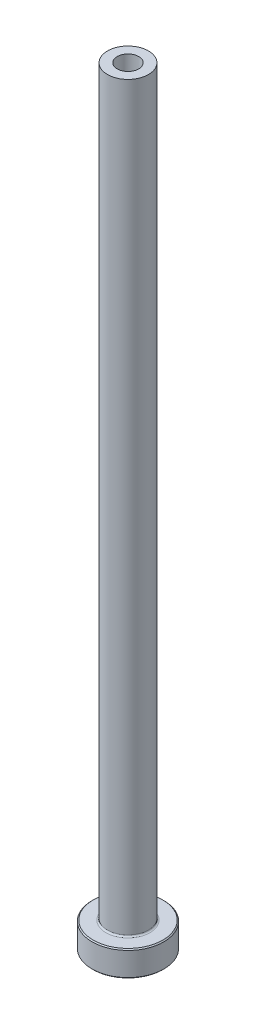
from build123d import *

# Parameters (mm, degrees)
FILLET1_R     = 0.3
CHAMFER1_SIZE = 0.2
CHAMFER3_SIZE = 0.5


with BuildPart() as part:
    # Sketch1 → Revolve1 (revolve)
    with BuildSketch(Plane.XY, mode=Mode.PRIVATE) as revolve1_sk:
        Polygon((-2.1, 150), (-4, 150), (-4, 5), (-7, 5), (-7, 0), (-2.35, 0), (-2.35, 93), (-2.1, 105), align=None)
    revolve(revolve1_sk.sketch.rotate(Axis((0, 92.187680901, 0), (0, -1, 0)), 270), axis=Axis((0, 92.187680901, 0), (0, -1, 0)))

    # Fillet1
    fillet1_edges = [part.edges().sort_by_distance(p)[0] for p in [
        (0, 5, -4),
    ]]
    fillet(fillet1_edges, radius=FILLET1_R)

    # Chamfer1
    chamfer1_edges = [part.edges().sort_by_distance(p)[0] for p in [
        (0, 0, -7),
        (0, 5, -7),
    ]]
    chamfer(chamfer1_edges, length=CHAMFER1_SIZE)

    # Chamfer3
    chamfer3_edges = [part.edges().sort_by_distance(p)[0] for p in [
        (0, 0, -2.35),
    ]]
    chamfer(chamfer3_edges, length=CHAMFER3_SIZE)


solid = part.part
